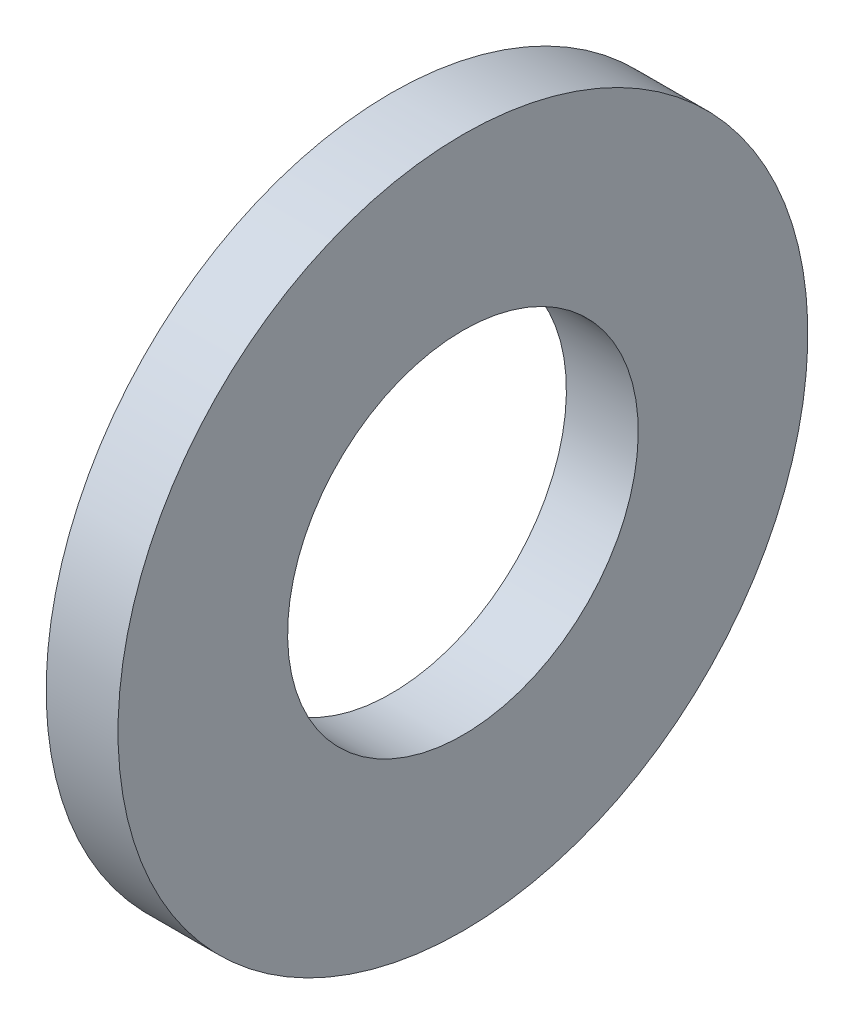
ISO-10303-21;
HEADER;
FILE_DESCRIPTION(('STEP AP214'),'2;1');
FILE_NAME('part.step','',(''),(''),'','','');
FILE_SCHEMA(('AUTOMOTIVE_DESIGN { 1 0 10303 214 1 1 1 1 }'));
ENDSEC;
DATA;
#1=APPLICATION_CONTEXT('core data for automotive mechanical design processes');
#2=APPLICATION_PROTOCOL_DEFINITION('international standard','automotive_design',2000,#1);
#3=PRODUCT_CONTEXT('',#1,'mechanical');
#4=PRODUCT('Part','Part','',(#3));
#5=PRODUCT_RELATED_PRODUCT_CATEGORY('part','',(#4));
#6=PRODUCT_DEFINITION_FORMATION('','',#4);
#7=PRODUCT_DEFINITION_CONTEXT('part definition',#1,'design');
#8=PRODUCT_DEFINITION('design','',#6,#7);
#9=PRODUCT_DEFINITION_SHAPE('','',#8);
#10=(LENGTH_UNIT() NAMED_UNIT(*) SI_UNIT(.MILLI.,.METRE.));
#11=(NAMED_UNIT(*) PLANE_ANGLE_UNIT() SI_UNIT($,.RADIAN.));
#12=(NAMED_UNIT(*) SI_UNIT($,.STERADIAN.) SOLID_ANGLE_UNIT());
#13=UNCERTAINTY_MEASURE_WITH_UNIT(LENGTH_MEASURE(1.E-05),#10,'distance_accuracy_value','');
#14=(GEOMETRIC_REPRESENTATION_CONTEXT(3) GLOBAL_UNCERTAINTY_ASSIGNED_CONTEXT((#13)) GLOBAL_UNIT_ASSIGNED_CONTEXT((#10,
#11,#12)) REPRESENTATION_CONTEXT('',''));
#15=CARTESIAN_POINT('',(0.,0.,0.));
#16=DIRECTION('',(0.,0.,1.));
#17=DIRECTION('',(1.,0.,0.));
#18=AXIS2_PLACEMENT_3D('',#15,#16,#17);
#19=CARTESIAN_POINT('',(2.5,0.,0.));
#20=DIRECTION('',(-1.,0.,0.));
#21=DIRECTION('',(0.,0.,1.));
#22=AXIS2_PLACEMENT_3D('',#19,#20,#21);
#23=CYLINDRICAL_SURFACE('',#22,6.1);
#24=CARTESIAN_POINT('',(2.5,0.,0.));
#25=DIRECTION('',(-1.,0.,0.));
#26=DIRECTION('',(0.,1.,0.));
#27=AXIS2_PLACEMENT_3D('',#24,#25,#26);
#28=CIRCLE('',#27,6.1);
#29=CARTESIAN_POINT('',(2.5,6.1,0.));
#30=VERTEX_POINT('',#29);
#31=EDGE_CURVE('E8',#30,#30,#28,.T.);
#32=ORIENTED_EDGE('',*,*,#31,.F.);
#33=EDGE_LOOP('',(#32));
#34=FACE_BOUND('',#33,.T.);
#35=CARTESIAN_POINT('',(0.,0.,0.));
#36=DIRECTION('',(-1.,0.,0.));
#37=DIRECTION('',(0.,1.,0.));
#38=AXIS2_PLACEMENT_3D('',#35,#36,#37);
#39=CIRCLE('',#38,6.1);
#40=CARTESIAN_POINT('',(0.,6.1,0.));
#41=VERTEX_POINT('',#40);
#42=EDGE_CURVE('E23',#41,#41,#39,.T.);
#43=ORIENTED_EDGE('',*,*,#42,.T.);
#44=EDGE_LOOP('',(#43));
#45=FACE_BOUND('',#44,.T.);
#46=ADVANCED_FACE('F12',(#34,#45),#23,.F.);
#47=CARTESIAN_POINT('',(2.5,0.,0.));
#48=DIRECTION('',(-1.,0.,0.));
#49=DIRECTION('',(0.,0.,1.));
#50=AXIS2_PLACEMENT_3D('',#47,#48,#49);
#51=CYLINDRICAL_SURFACE('',#50,12.);
#52=CARTESIAN_POINT('',(2.5,0.,0.));
#53=DIRECTION('',(-1.,0.,0.));
#54=DIRECTION('',(0.,1.,0.));
#55=AXIS2_PLACEMENT_3D('',#52,#53,#54);
#56=CIRCLE('',#55,12.);
#57=CARTESIAN_POINT('',(2.5,12.,0.));
#58=VERTEX_POINT('',#57);
#59=EDGE_CURVE('E19',#58,#58,#56,.T.);
#60=ORIENTED_EDGE('',*,*,#59,.T.);
#61=EDGE_LOOP('',(#60));
#62=FACE_BOUND('',#61,.T.);
#63=CARTESIAN_POINT('',(0.,0.,0.));
#64=DIRECTION('',(-1.,0.,0.));
#65=DIRECTION('',(0.,1.,0.));
#66=AXIS2_PLACEMENT_3D('',#63,#64,#65);
#67=CIRCLE('',#66,12.);
#68=CARTESIAN_POINT('',(0.,12.,0.));
#69=VERTEX_POINT('',#68);
#70=EDGE_CURVE('E28',#69,#69,#67,.T.);
#71=ORIENTED_EDGE('',*,*,#70,.F.);
#72=EDGE_LOOP('',(#71));
#73=FACE_BOUND('',#72,.T.);
#74=ADVANCED_FACE('F14',(#62,#73),#51,.T.);
#75=CARTESIAN_POINT('',(2.5,0.,0.));
#76=DIRECTION('',(-1.,0.,0.));
#77=DIRECTION('',(0.,-1.,0.));
#78=AXIS2_PLACEMENT_3D('',#75,#76,#77);
#79=PLANE('',#78);
#80=ORIENTED_EDGE('',*,*,#31,.T.);
#81=EDGE_LOOP('',(#80));
#82=FACE_BOUND('',#81,.T.);
#83=ORIENTED_EDGE('',*,*,#59,.F.);
#84=EDGE_LOOP('',(#83));
#85=FACE_BOUND('',#84,.T.);
#86=ADVANCED_FACE('F40',(#82,#85),#79,.F.);
#87=CARTESIAN_POINT('',(0.,0.,0.));
#88=DIRECTION('',(-1.,0.,0.));
#89=DIRECTION('',(0.,-1.,0.));
#90=AXIS2_PLACEMENT_3D('',#87,#88,#89);
#91=PLANE('',#90);
#92=ORIENTED_EDGE('',*,*,#42,.F.);
#93=EDGE_LOOP('',(#92));
#94=FACE_BOUND('',#93,.T.);
#95=ORIENTED_EDGE('',*,*,#70,.T.);
#96=EDGE_LOOP('',(#95));
#97=FACE_BOUND('',#96,.T.);
#98=ADVANCED_FACE('F37',(#94,#97),#91,.T.);
#99=CLOSED_SHELL('',(#46,#74,#86,#98));
#100=MANIFOLD_SOLID_BREP('B1',#99);
#101=ADVANCED_BREP_SHAPE_REPRESENTATION('',(#18,#100),#14);
#102=SHAPE_DEFINITION_REPRESENTATION(#9,#101);
ENDSEC;
END-ISO-10303-21;
